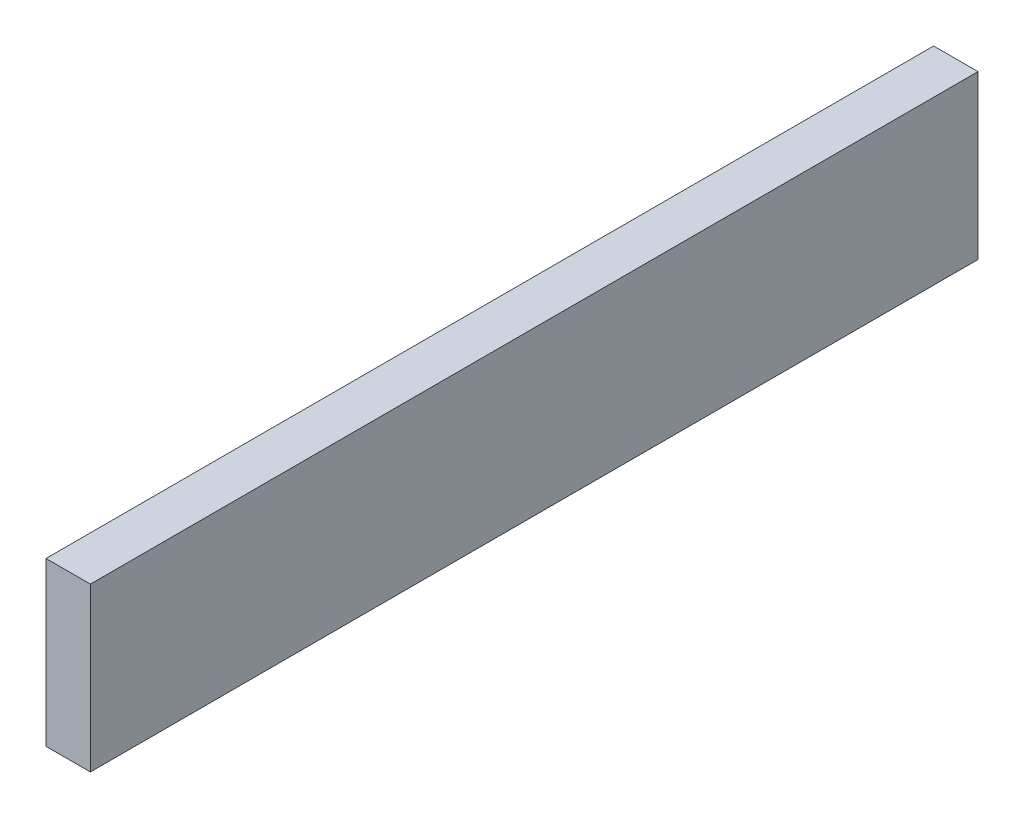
ISO-10303-21;
HEADER;
FILE_DESCRIPTION(('STEP AP214'),'2;1');
FILE_NAME('part.step','',(''),(''),'','','');
FILE_SCHEMA(('AUTOMOTIVE_DESIGN { 1 0 10303 214 1 1 1 1 }'));
ENDSEC;
DATA;
#1=APPLICATION_CONTEXT('core data for automotive mechanical design processes');
#2=APPLICATION_PROTOCOL_DEFINITION('international standard','automotive_design',2000,#1);
#3=PRODUCT_CONTEXT('',#1,'mechanical');
#4=PRODUCT('Part','Part','',(#3));
#5=PRODUCT_RELATED_PRODUCT_CATEGORY('part','',(#4));
#6=PRODUCT_DEFINITION_FORMATION('','',#4);
#7=PRODUCT_DEFINITION_CONTEXT('part definition',#1,'design');
#8=PRODUCT_DEFINITION('design','',#6,#7);
#9=PRODUCT_DEFINITION_SHAPE('','',#8);
#10=(LENGTH_UNIT() NAMED_UNIT(*) SI_UNIT(.MILLI.,.METRE.));
#11=(NAMED_UNIT(*) PLANE_ANGLE_UNIT() SI_UNIT($,.RADIAN.));
#12=(NAMED_UNIT(*) SI_UNIT($,.STERADIAN.) SOLID_ANGLE_UNIT());
#13=UNCERTAINTY_MEASURE_WITH_UNIT(LENGTH_MEASURE(1.E-05),#10,'distance_accuracy_value','');
#14=(GEOMETRIC_REPRESENTATION_CONTEXT(3) GLOBAL_UNCERTAINTY_ASSIGNED_CONTEXT((#13)) GLOBAL_UNIT_ASSIGNED_CONTEXT((#10,
#11,#12)) REPRESENTATION_CONTEXT('',''));
#15=CARTESIAN_POINT('',(0.,0.,0.));
#16=DIRECTION('',(0.,0.,1.));
#17=DIRECTION('',(1.,0.,0.));
#18=AXIS2_PLACEMENT_3D('',#15,#16,#17);
#19=CARTESIAN_POINT('',(0.,0.,762.));
#20=DIRECTION('',(1.,0.,0.));
#21=DIRECTION('',(0.,0.,-1.));
#22=AXIS2_PLACEMENT_3D('',#19,#20,#21);
#23=PLANE('',#22);
#24=DIRECTION('',(0.,-1.,0.));
#25=VECTOR('',#24,1.);
#26=CARTESIAN_POINT('',(0.,0.,0.));
#27=LINE('',#26,#25);
#28=CARTESIAN_POINT('',(0.,139.7,0.));
#29=VERTEX_POINT('',#28);
#30=CARTESIAN_POINT('',(0.,0.,0.));
#31=VERTEX_POINT('',#30);
#32=EDGE_CURVE('E102',#29,#31,#27,.T.);
#33=ORIENTED_EDGE('',*,*,#32,.T.);
#34=DIRECTION('',(0.,0.,-1.));
#35=VECTOR('',#34,1.);
#36=CARTESIAN_POINT('',(0.,0.,762.));
#37=LINE('',#36,#35);
#38=CARTESIAN_POINT('',(0.,0.,762.));
#39=VERTEX_POINT('',#38);
#40=EDGE_CURVE('E11',#39,#31,#37,.T.);
#41=ORIENTED_EDGE('',*,*,#40,.F.);
#42=DIRECTION('',(0.,-1.,0.));
#43=VECTOR('',#42,1.);
#44=CARTESIAN_POINT('',(0.,0.,762.));
#45=LINE('',#44,#43);
#46=CARTESIAN_POINT('',(0.,139.7,762.));
#47=VERTEX_POINT('',#46);
#48=EDGE_CURVE('E90',#47,#39,#45,.T.);
#49=ORIENTED_EDGE('',*,*,#48,.F.);
#50=DIRECTION('',(0.,0.,-1.));
#51=VECTOR('',#50,1.);
#52=CARTESIAN_POINT('',(0.,139.7,762.));
#53=LINE('',#52,#51);
#54=EDGE_CURVE('E98',#47,#29,#53,.T.);
#55=ORIENTED_EDGE('',*,*,#54,.T.);
#56=EDGE_LOOP('',(#33,#41,#49,#55));
#57=FACE_BOUND('',#56,.T.);
#58=ADVANCED_FACE('F39',(#57),#23,.F.);
#59=CARTESIAN_POINT('',(0.,0.,762.));
#60=DIRECTION('',(0.,1.,0.));
#61=DIRECTION('',(0.,0.,1.));
#62=AXIS2_PLACEMENT_3D('',#59,#60,#61);
#63=PLANE('',#62);
#64=DIRECTION('',(1.,0.,0.));
#65=VECTOR('',#64,1.);
#66=CARTESIAN_POINT('',(0.,0.,0.));
#67=LINE('',#66,#65);
#68=CARTESIAN_POINT('',(38.1,0.,0.));
#69=VERTEX_POINT('',#68);
#70=EDGE_CURVE('E94',#31,#69,#67,.T.);
#71=ORIENTED_EDGE('',*,*,#70,.T.);
#72=DIRECTION('',(0.,0.,-1.));
#73=VECTOR('',#72,1.);
#74=CARTESIAN_POINT('',(38.1,0.,762.));
#75=LINE('',#74,#73);
#76=CARTESIAN_POINT('',(38.1,0.,762.));
#77=VERTEX_POINT('',#76);
#78=EDGE_CURVE('E47',#77,#69,#75,.T.);
#79=ORIENTED_EDGE('',*,*,#78,.F.);
#80=DIRECTION('',(1.,0.,0.));
#81=VECTOR('',#80,1.);
#82=CARTESIAN_POINT('',(0.,0.,762.));
#83=LINE('',#82,#81);
#84=EDGE_CURVE('E85',#39,#77,#83,.T.);
#85=ORIENTED_EDGE('',*,*,#84,.F.);
#86=ORIENTED_EDGE('',*,*,#40,.T.);
#87=EDGE_LOOP('',(#71,#79,#85,#86));
#88=FACE_BOUND('',#87,.T.);
#89=ADVANCED_FACE('F93',(#88),#63,.F.);
#90=CARTESIAN_POINT('',(38.1,0.,762.));
#91=DIRECTION('',(-1.,0.,0.));
#92=DIRECTION('',(0.,-1.,0.));
#93=AXIS2_PLACEMENT_3D('',#90,#91,#92);
#94=PLANE('',#93);
#95=DIRECTION('',(0.,1.,0.));
#96=VECTOR('',#95,1.);
#97=CARTESIAN_POINT('',(38.1,0.,0.));
#98=LINE('',#97,#96);
#99=CARTESIAN_POINT('',(38.1,139.7,0.));
#100=VERTEX_POINT('',#99);
#101=EDGE_CURVE('E72',#69,#100,#98,.T.);
#102=ORIENTED_EDGE('',*,*,#101,.T.);
#103=DIRECTION('',(0.,0.,-1.));
#104=VECTOR('',#103,1.);
#105=CARTESIAN_POINT('',(38.1,139.7,762.));
#106=LINE('',#105,#104);
#107=CARTESIAN_POINT('',(38.1,139.7,762.));
#108=VERTEX_POINT('',#107);
#109=EDGE_CURVE('E95',#108,#100,#106,.T.);
#110=ORIENTED_EDGE('',*,*,#109,.F.);
#111=DIRECTION('',(0.,1.,0.));
#112=VECTOR('',#111,1.);
#113=CARTESIAN_POINT('',(38.1,0.,762.));
#114=LINE('',#113,#112);
#115=EDGE_CURVE('E88',#77,#108,#114,.T.);
#116=ORIENTED_EDGE('',*,*,#115,.F.);
#117=ORIENTED_EDGE('',*,*,#78,.T.);
#118=EDGE_LOOP('',(#102,#110,#116,#117));
#119=FACE_BOUND('',#118,.T.);
#120=ADVANCED_FACE('F96',(#119),#94,.F.);
#121=CARTESIAN_POINT('',(0.,139.7,762.));
#122=DIRECTION('',(0.,-1.,0.));
#123=DIRECTION('',(0.,0.,-1.));
#124=AXIS2_PLACEMENT_3D('',#121,#122,#123);
#125=PLANE('',#124);
#126=DIRECTION('',(-1.,0.,0.));
#127=VECTOR('',#126,1.);
#128=CARTESIAN_POINT('',(0.,139.7,0.));
#129=LINE('',#128,#127);
#130=EDGE_CURVE('E78',#100,#29,#129,.T.);
#131=ORIENTED_EDGE('',*,*,#130,.T.);
#132=ORIENTED_EDGE('',*,*,#54,.F.);
#133=DIRECTION('',(-1.,0.,0.));
#134=VECTOR('',#133,1.);
#135=CARTESIAN_POINT('',(0.,139.7,762.));
#136=LINE('',#135,#134);
#137=EDGE_CURVE('E55',#108,#47,#136,.T.);
#138=ORIENTED_EDGE('',*,*,#137,.F.);
#139=ORIENTED_EDGE('',*,*,#109,.T.);
#140=EDGE_LOOP('',(#131,#132,#138,#139));
#141=FACE_BOUND('',#140,.T.);
#142=ADVANCED_FACE('F109',(#141),#125,.F.);
#143=CARTESIAN_POINT('',(0.,0.,762.));
#144=DIRECTION('',(0.,0.,-1.));
#145=DIRECTION('',(-1.,0.,0.));
#146=AXIS2_PLACEMENT_3D('',#143,#144,#145);
#147=PLANE('',#146);
#148=ORIENTED_EDGE('',*,*,#48,.T.);
#149=ORIENTED_EDGE('',*,*,#84,.T.);
#150=ORIENTED_EDGE('',*,*,#115,.T.);
#151=ORIENTED_EDGE('',*,*,#137,.T.);
#152=EDGE_LOOP('',(#148,#149,#150,#151));
#153=FACE_BOUND('',#152,.T.);
#154=ADVANCED_FACE('F86',(#153),#147,.F.);
#155=CARTESIAN_POINT('',(0.,0.,0.));
#156=DIRECTION('',(0.,0.,-1.));
#157=DIRECTION('',(-1.,0.,0.));
#158=AXIS2_PLACEMENT_3D('',#155,#156,#157);
#159=PLANE('',#158);
#160=ORIENTED_EDGE('',*,*,#32,.F.);
#161=ORIENTED_EDGE('',*,*,#130,.F.);
#162=ORIENTED_EDGE('',*,*,#101,.F.);
#163=ORIENTED_EDGE('',*,*,#70,.F.);
#164=EDGE_LOOP('',(#160,#161,#162,#163));
#165=FACE_BOUND('',#164,.T.);
#166=ADVANCED_FACE('F112',(#165),#159,.T.);
#167=CLOSED_SHELL('',(#58,#89,#120,#142,#154,#166));
#168=MANIFOLD_SOLID_BREP('B2',#167);
#169=ADVANCED_BREP_SHAPE_REPRESENTATION('',(#18,#168),#14);
#170=SHAPE_DEFINITION_REPRESENTATION(#9,#169);
ENDSEC;
END-ISO-10303-21;
